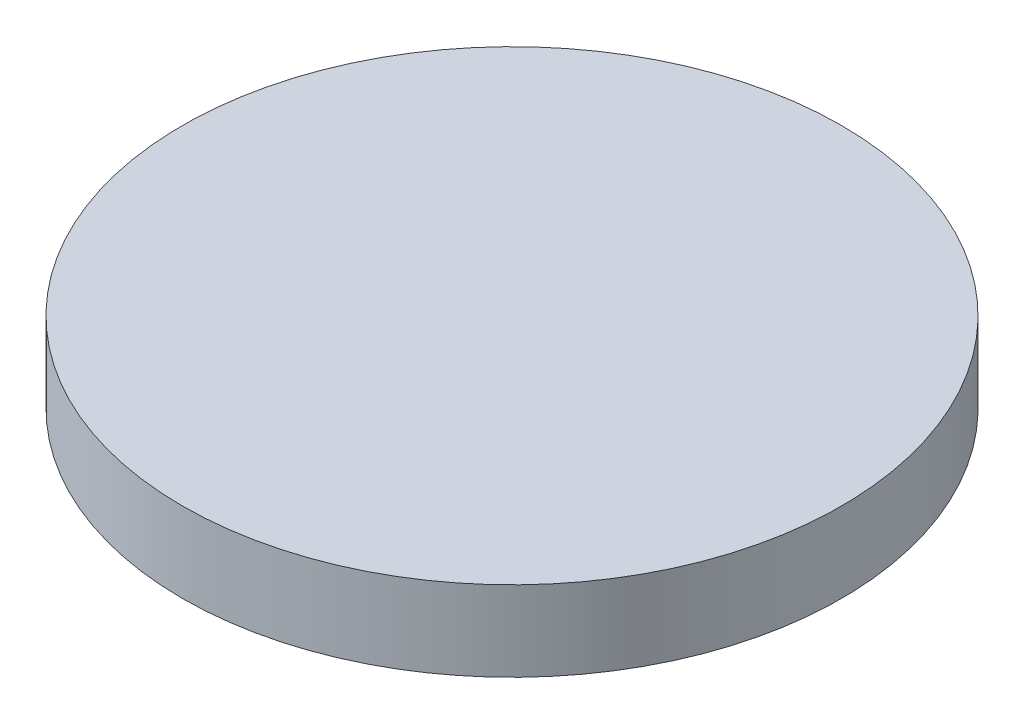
ISO-10303-21;
HEADER;
FILE_DESCRIPTION(('STEP AP214'),'2;1');
FILE_NAME('part.step','',(''),(''),'','','');
FILE_SCHEMA(('AUTOMOTIVE_DESIGN { 1 0 10303 214 1 1 1 1 }'));
ENDSEC;
DATA;
#1=APPLICATION_CONTEXT('core data for automotive mechanical design processes');
#2=APPLICATION_PROTOCOL_DEFINITION('international standard','automotive_design',2000,#1);
#3=PRODUCT_CONTEXT('',#1,'mechanical');
#4=PRODUCT('Part','Part','',(#3));
#5=PRODUCT_RELATED_PRODUCT_CATEGORY('part','',(#4));
#6=PRODUCT_DEFINITION_FORMATION('','',#4);
#7=PRODUCT_DEFINITION_CONTEXT('part definition',#1,'design');
#8=PRODUCT_DEFINITION('design','',#6,#7);
#9=PRODUCT_DEFINITION_SHAPE('','',#8);
#10=(LENGTH_UNIT() NAMED_UNIT(*) SI_UNIT(.MILLI.,.METRE.));
#11=(NAMED_UNIT(*) PLANE_ANGLE_UNIT() SI_UNIT($,.RADIAN.));
#12=(NAMED_UNIT(*) SI_UNIT($,.STERADIAN.) SOLID_ANGLE_UNIT());
#13=UNCERTAINTY_MEASURE_WITH_UNIT(LENGTH_MEASURE(1.E-05),#10,'distance_accuracy_value','');
#14=(GEOMETRIC_REPRESENTATION_CONTEXT(3) GLOBAL_UNCERTAINTY_ASSIGNED_CONTEXT((#13)) GLOBAL_UNIT_ASSIGNED_CONTEXT((#10,
#11,#12)) REPRESENTATION_CONTEXT('',''));
#15=CARTESIAN_POINT('',(0.,0.,0.));
#16=DIRECTION('',(0.,0.,1.));
#17=DIRECTION('',(1.,0.,0.));
#18=AXIS2_PLACEMENT_3D('',#15,#16,#17);
#19=CARTESIAN_POINT('',(0.,13.97,0.));
#20=DIRECTION('',(0.,-1.,0.));
#21=DIRECTION('',(0.,0.,-1.));
#22=AXIS2_PLACEMENT_3D('',#19,#20,#21);
#23=CYLINDRICAL_SURFACE('',#22,57.4675);
#24=CARTESIAN_POINT('',(0.,13.97,0.));
#25=DIRECTION('',(0.,1.,0.));
#26=DIRECTION('',(0.,0.,1.));
#27=AXIS2_PLACEMENT_3D('',#24,#25,#26);
#28=CIRCLE('',#27,57.4675);
#29=CARTESIAN_POINT('',(0.,13.97,57.4675));
#30=VERTEX_POINT('',#29);
#31=EDGE_CURVE('E10',#30,#30,#28,.T.);
#32=ORIENTED_EDGE('',*,*,#31,.F.);
#33=EDGE_LOOP('',(#32));
#34=FACE_BOUND('',#33,.T.);
#35=CARTESIAN_POINT('',(0.,0.,0.));
#36=DIRECTION('',(0.,1.,0.));
#37=DIRECTION('',(0.,0.,1.));
#38=AXIS2_PLACEMENT_3D('',#35,#36,#37);
#39=CIRCLE('',#38,57.4675);
#40=CARTESIAN_POINT('',(0.,0.,57.4675));
#41=VERTEX_POINT('',#40);
#42=EDGE_CURVE('E38',#41,#41,#39,.T.);
#43=ORIENTED_EDGE('',*,*,#42,.T.);
#44=EDGE_LOOP('',(#43));
#45=FACE_BOUND('',#44,.T.);
#46=ADVANCED_FACE('F35',(#34,#45),#23,.T.);
#47=CARTESIAN_POINT('',(0.,13.97,0.));
#48=DIRECTION('',(0.,1.,0.));
#49=DIRECTION('',(0.,0.,1.));
#50=AXIS2_PLACEMENT_3D('',#47,#48,#49);
#51=PLANE('',#50);
#52=ORIENTED_EDGE('',*,*,#31,.T.);
#53=EDGE_LOOP('',(#52));
#54=FACE_BOUND('',#53,.T.);
#55=ADVANCED_FACE('F50',(#54),#51,.T.);
#56=CARTESIAN_POINT('',(0.,0.,0.));
#57=DIRECTION('',(0.,1.,0.));
#58=DIRECTION('',(0.,0.,1.));
#59=AXIS2_PLACEMENT_3D('',#56,#57,#58);
#60=PLANE('',#59);
#61=ORIENTED_EDGE('',*,*,#42,.F.);
#62=EDGE_LOOP('',(#61));
#63=FACE_BOUND('',#62,.T.);
#64=ADVANCED_FACE('F48',(#63),#60,.F.);
#65=CLOSED_SHELL('',(#46,#55,#64));
#66=MANIFOLD_SOLID_BREP('B2',#65);
#67=ADVANCED_BREP_SHAPE_REPRESENTATION('',(#18,#66),#14);
#68=SHAPE_DEFINITION_REPRESENTATION(#9,#67);
ENDSEC;
END-ISO-10303-21;
